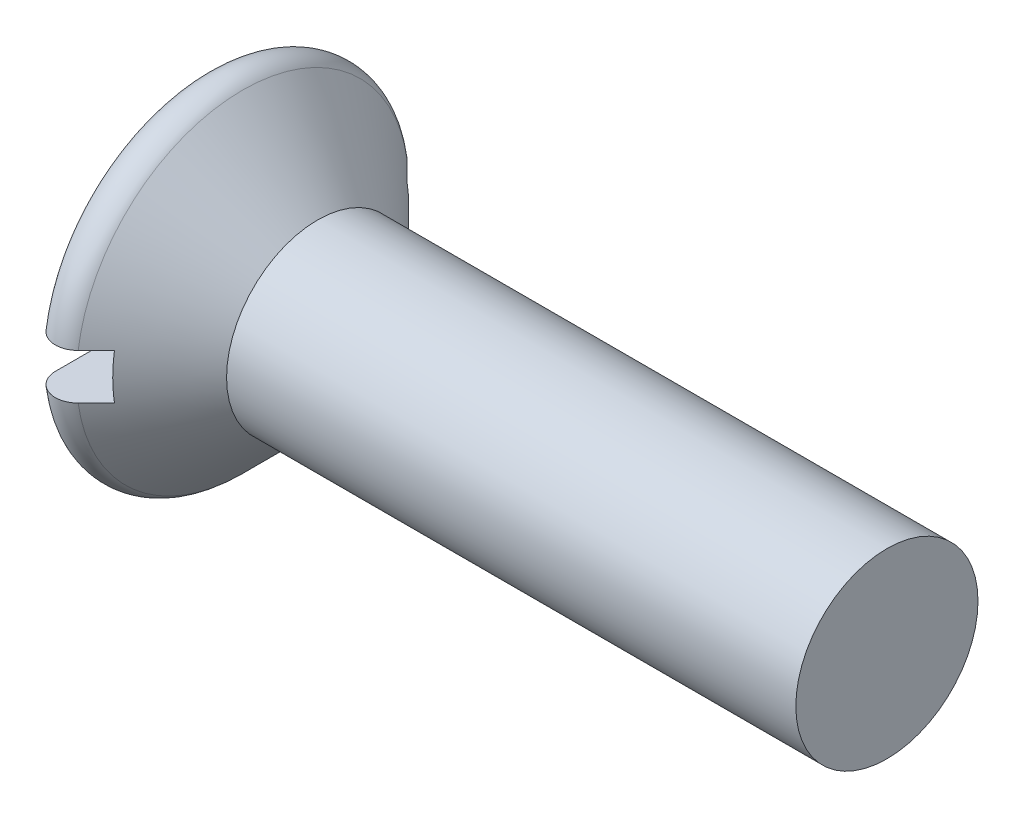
from build123d import *

# Parameters (mm, degrees)
HEADFILLET_R     = 0.2
NOTCH_DEPTH      = 7.372090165
NOTCH_DEPTH_BACK = 7.372090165
SKETCH2_W        = 0.5
SKETCH2_H        = 0.4


with BuildPart() as part:
    # Sketch1 → Base (revolve)
    with BuildSketch(Plane.XY, mode=Mode.PRIVATE) as base_sk:
        Polygon((0, 0), (0, 1.8), (1, 0.8), (6, 0.8), (6, 0), align=None)
    revolve(base_sk.sketch.rotate(Axis((-5.569640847, 0, 0), (1, 0, 0)), 90), axis=Axis((-5.569640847, 0, 0), (1, 0, 0)))

    # HeadFillet
    headfillet_edges = [part.edges().sort_by_distance(p)[0] for p in [
        (0, 0, -1.8),
    ]]
    fillet(headfillet_edges, radius=HEADFILLET_R)

    # Sketch2 → Notch (cut, two sides: drawn at the far end of the back side and taken through both)
    with BuildSketch(Plane.XY.offset(-NOTCH_DEPTH_BACK)):
        with Locations((0.25, 0)):
            Rectangle(SKETCH2_W, SKETCH2_H)
    extrude(amount=NOTCH_DEPTH + NOTCH_DEPTH_BACK, mode=Mode.SUBTRACT)


solid = part.part
